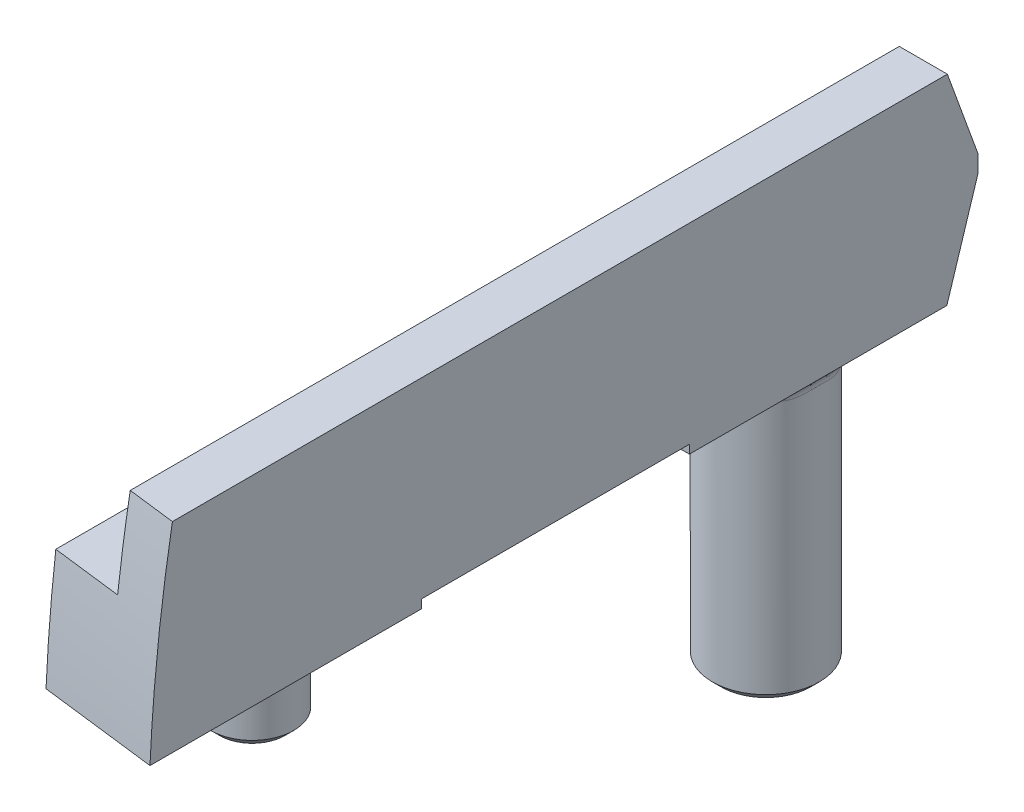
from build123d import *

# Parameters (mm, degrees)
BOSS_EXTRUDE1_DEPTH = 24.4856
SKETCH3_W           = 7.9248
SKETCH3_H           = 0.254
CUT_EXTRUDE2_DEPTH  = 12.2428
SKETCH4_R           = 1.58115
BOSS_EXTRUDE2_DEPTH = 8.128
SKETCH4_3_R         = 1.22555
BOSS_EXTRUDE3_DEPTH = 2.286
CHAMFER1_SIZE       = 0.254
FILLET1_R           = 0.381
CUT_EXTRUDE4_DEPTH  = 7.493
CUT_EXTRUDE1_DEPTH  = 12.2428


with BuildPart() as part:
    # Sketch1 → Boss-Extrude1 (new body)
    with BuildSketch(Plane.XY):
        Polygon((0, 0), (0, 3.429), (2.0828, 3.429), (2.0828, 5.9182), (3.5052, 5.9182), (3.5052, 0), align=None)
    extrude(amount=BOSS_EXTRUDE1_DEPTH)

    # Sketch3 → Cut-Extrude2 (cut, symmetric)
    with BuildSketch(Plane.ZY):
        with Locations((12.4968, 0.127)):
            Rectangle(SKETCH3_W, SKETCH3_H)
    extrude(amount=CUT_EXTRUDE2_DEPTH, both=True, mode=Mode.SUBTRACT)

    # Sketch4 → Boss-Extrude2 (add)
    with BuildSketch(Plane.XZ):
        with Locations(Location((1.8034, 4.572, 0), (0, 0, 180))):
            Circle(SKETCH4_R)
    extrude(amount=BOSS_EXTRUDE2_DEPTH)

    # Sketch4_3 → Boss-Extrude3 (add)
    with BuildSketch(Plane.XZ):
        with Locations(Location((1.4732, 19.431, 0), (0, 0, 180))):
            Circle(SKETCH4_3_R)
    extrude(amount=BOSS_EXTRUDE3_DEPTH)

    # Chamfer1
    chamfer1_edges = [part.edges().sort_by_distance(p)[0] for p in [
        (3.38455, -8.128, 4.572),
        (2.69875, -2.286, 19.431),
    ]]
    chamfer(chamfer1_edges, length=CHAMFER1_SIZE)

    # Fillet1
    fillet1_edges = [part.edges().sort_by_distance(p)[0] for p in [
        (3.38455, 0, 4.572),
        (2.69875, 0, 19.431),
    ]]
    fillet(fillet1_edges, radius=FILLET1_R)

    # Sketch7 → Cut-Extrude4 (cut, symmetric)
    with BuildSketch(Plane(origin=(0, 3.429, 0), x_dir=(1, 0, 0), z_dir=(0, 1, 0))):
        Polygon((3.5052, -24.4856), (0, -24.055215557), (0, -25.525906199), (6.557870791, -24.860420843), align=None)
    extrude(amount=CUT_EXTRUDE4_DEPTH, both=True, mode=Mode.SUBTRACT)

    # Sketch2 → Cut-Extrude1 (cut, symmetric)
    with BuildSketch(Plane.ZY):
        Polygon((0.905994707, 5.9182), (0, 3.429), (0, 5.9182), align=None)
        Polygon((0, 2.921), (0.920987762, 0), (0, 0), align=None)
    extrude(amount=CUT_EXTRUDE1_DEPTH, both=True, mode=Mode.SUBTRACT)

    # Cut-Sweep1: sweep along a curve in space
    with BuildLine() as cut_sweep1_path:
        Line((3.5052, 0, 24.4856), (0, 0, 24.055215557))
    # Sketch8 → Cut-Sweep1 (sweep, cut)
    with BuildSketch(Plane.ZY):
        with BuildLine():
            Line((23.202273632, 6.918647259), (26.398596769, 6.918647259))
            Line((26.398596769, 6.918647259), (24.800435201, -5.214023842))
            Line((24.800435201, -5.214023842), (24.055215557, 0))
            ThreePointArc((24.055215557, 0), (23.75984972, 3.47548648), (23.202273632, 6.918647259))
        make_face()
    sweep(path=cut_sweep1_path.line, mode=Mode.SUBTRACT)


solid = part.part
